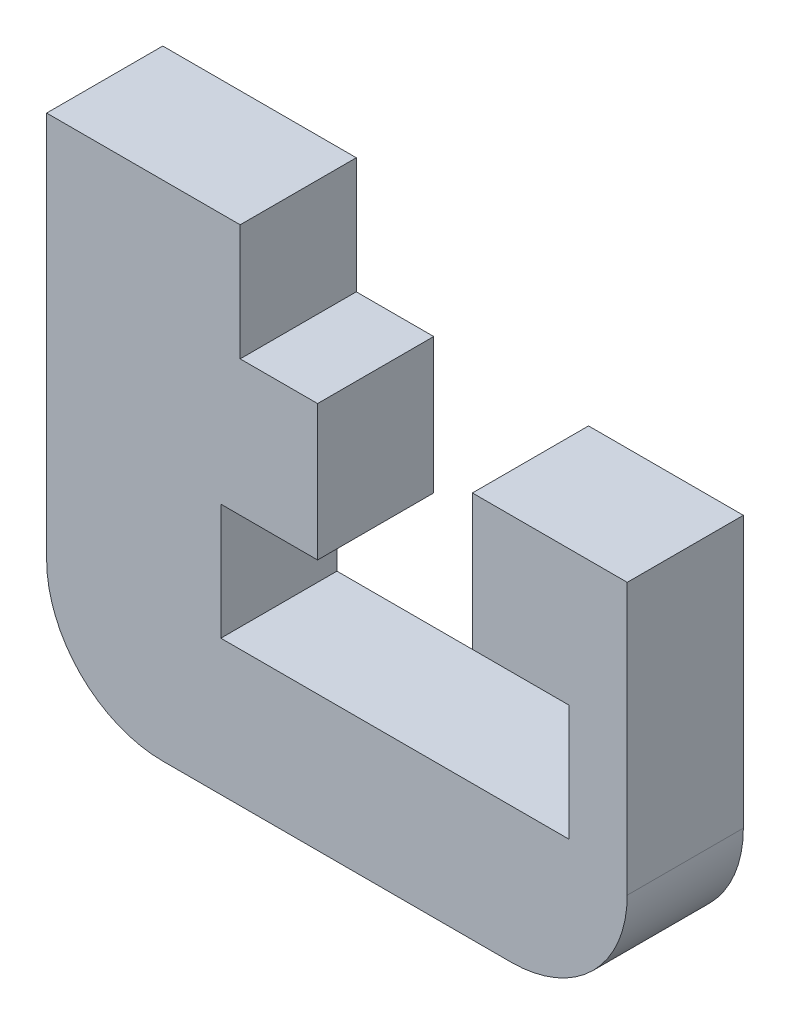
from build123d import *

# Parameters (mm, degrees)
SALIENTE_EXTRUIR1_DEPTH = 3


with BuildPart() as part:
    # Croquis1 → Saliente-Extruir1 (new body)
    with BuildSketch(Plane.XY):
        with BuildLine():
            Line((0, 22.001027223), (-5, 22.001027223))
            Line((-5, 22.001027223), (-5, 12.001027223))
            ThreePointArc((-5, 12.001027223), (-4.121320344, 9.87970688), (-2, 9.001027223))
            Line((-2, 9.001027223), (7, 9.001027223))
            ThreePointArc((7, 9.001027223), (9.121320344, 9.87970688), (10, 12.001027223))
            Line((10, 12.001027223), (10, 19.001027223))
            Line((10, 19.001027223), (6, 19.001027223))
            Line((6, 19.001027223), (6, 15.501027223))
            Line((6, 15.501027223), (8.5, 15.501027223))
            Line((8.5, 15.501027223), (8.5, 12.501027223))
            Line((8.5, 12.501027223), (-0.5, 12.501027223))
            Line((-0.5, 12.501027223), (-0.5, 15.501027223))
            Line((-0.5, 15.501027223), (2, 15.501027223))
            Line((2, 15.501027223), (2, 19.001027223))
            Line((2, 19.001027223), (0, 19.001027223))
            Line((0, 19.001027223), (0, 22.001027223))
        make_face()
    extrude(amount=SALIENTE_EXTRUIR1_DEPTH)


solid = part.part
